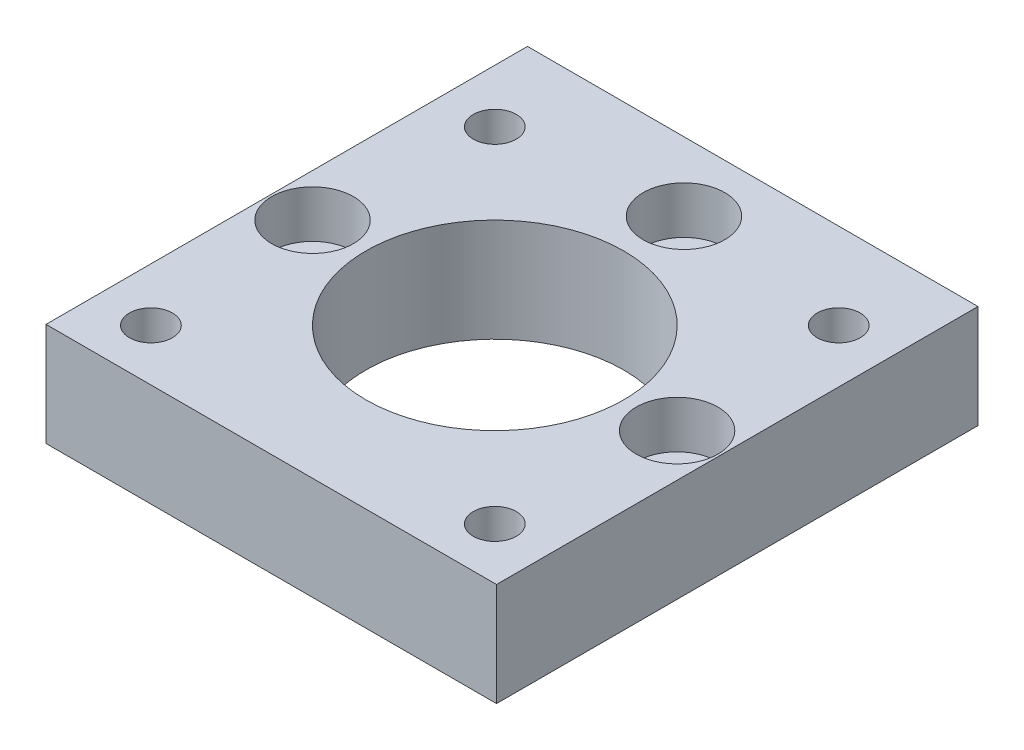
ISO-10303-21;
HEADER;
FILE_DESCRIPTION(('STEP AP214'),'2;1');
FILE_NAME('part.step','',(''),(''),'','','');
FILE_SCHEMA(('AUTOMOTIVE_DESIGN { 1 0 10303 214 1 1 1 1 }'));
ENDSEC;
DATA;
#1=APPLICATION_CONTEXT('core data for automotive mechanical design processes');
#2=APPLICATION_PROTOCOL_DEFINITION('international standard','automotive_design',2000,#1);
#3=PRODUCT_CONTEXT('',#1,'mechanical');
#4=PRODUCT('Part','Part','',(#3));
#5=PRODUCT_RELATED_PRODUCT_CATEGORY('part','',(#4));
#6=PRODUCT_DEFINITION_FORMATION('','',#4);
#7=PRODUCT_DEFINITION_CONTEXT('part definition',#1,'design');
#8=PRODUCT_DEFINITION('design','',#6,#7);
#9=PRODUCT_DEFINITION_SHAPE('','',#8);
#10=(LENGTH_UNIT() NAMED_UNIT(*) SI_UNIT(.MILLI.,.METRE.));
#11=(NAMED_UNIT(*) PLANE_ANGLE_UNIT() SI_UNIT($,.RADIAN.));
#12=(NAMED_UNIT(*) SI_UNIT($,.STERADIAN.) SOLID_ANGLE_UNIT());
#13=UNCERTAINTY_MEASURE_WITH_UNIT(LENGTH_MEASURE(1.E-05),#10,'distance_accuracy_value','');
#14=(GEOMETRIC_REPRESENTATION_CONTEXT(3) GLOBAL_UNCERTAINTY_ASSIGNED_CONTEXT((#13)) GLOBAL_UNIT_ASSIGNED_CONTEXT((#10,
#11,#12)) REPRESENTATION_CONTEXT('',''));
#15=CARTESIAN_POINT('',(0.,0.,0.));
#16=DIRECTION('',(0.,0.,1.));
#17=DIRECTION('',(1.,0.,0.));
#18=AXIS2_PLACEMENT_3D('',#15,#16,#17);
#19=CARTESIAN_POINT('',(26.2000000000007,-44.,8.));
#20=DIRECTION('',(0.,1.,0.));
#21=DIRECTION('',(0.,0.,1.));
#22=AXIS2_PLACEMENT_3D('',#19,#20,#21);
#23=CYLINDRICAL_SURFACE('',#22,2.75);
#24=CARTESIAN_POINT('',(26.2000000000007,0.,8.));
#25=DIRECTION('',(0.,1.,0.));
#26=DIRECTION('',(0.,0.,1.));
#27=AXIS2_PLACEMENT_3D('',#24,#25,#26);
#28=CIRCLE('',#27,2.75);
#29=CARTESIAN_POINT('',(26.2000000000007,0.,10.75));
#30=VERTEX_POINT('',#29);
#31=EDGE_CURVE('E111',#30,#30,#28,.T.);
#32=ORIENTED_EDGE('',*,*,#31,.F.);
#33=EDGE_LOOP('',(#32));
#34=FACE_BOUND('',#33,.T.);
#35=CARTESIAN_POINT('',(26.2000000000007,6.5,8.));
#36=DIRECTION('',(0.,1.,0.));
#37=DIRECTION('',(0.,0.,1.));
#38=AXIS2_PLACEMENT_3D('',#35,#36,#37);
#39=CIRCLE('',#38,2.75);
#40=CARTESIAN_POINT('',(26.2000000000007,6.5,10.75));
#41=VERTEX_POINT('',#40);
#42=EDGE_CURVE('E37',#41,#41,#39,.F.);
#43=ORIENTED_EDGE('',*,*,#42,.F.);
#44=EDGE_LOOP('',(#43));
#45=FACE_BOUND('',#44,.T.);
#46=ADVANCED_FACE('F33',(#34,#45),#23,.F.);
#47=CARTESIAN_POINT('',(5.,-44.,30.));
#48=DIRECTION('',(0.,1.,0.));
#49=DIRECTION('',(0.,0.,1.));
#50=AXIS2_PLACEMENT_3D('',#47,#48,#49);
#51=CYLINDRICAL_SURFACE('',#50,2.75);
#52=CARTESIAN_POINT('',(5.,0.,30.));
#53=DIRECTION('',(0.,1.,0.));
#54=DIRECTION('',(0.,0.,1.));
#55=AXIS2_PLACEMENT_3D('',#52,#53,#54);
#56=CIRCLE('',#55,2.75);
#57=CARTESIAN_POINT('',(5.,0.,32.75));
#58=VERTEX_POINT('',#57);
#59=EDGE_CURVE('E136',#58,#58,#56,.T.);
#60=ORIENTED_EDGE('',*,*,#59,.F.);
#61=EDGE_LOOP('',(#60));
#62=FACE_BOUND('',#61,.T.);
#63=CARTESIAN_POINT('',(5.,6.5,30.));
#64=DIRECTION('',(0.,1.,0.));
#65=DIRECTION('',(0.,0.,1.));
#66=AXIS2_PLACEMENT_3D('',#63,#64,#65);
#67=CIRCLE('',#66,2.75);
#68=CARTESIAN_POINT('',(5.,6.5,32.75));
#69=VERTEX_POINT('',#68);
#70=EDGE_CURVE('E113',#69,#69,#67,.F.);
#71=ORIENTED_EDGE('',*,*,#70,.F.);
#72=EDGE_LOOP('',(#71));
#73=FACE_BOUND('',#72,.T.);
#74=ADVANCED_FACE('F190',(#62,#73),#51,.F.);
#75=CARTESIAN_POINT('',(47.4000000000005,-44.,30.));
#76=DIRECTION('',(0.,1.,0.));
#77=DIRECTION('',(0.,0.,1.));
#78=AXIS2_PLACEMENT_3D('',#75,#76,#77);
#79=CYLINDRICAL_SURFACE('',#78,2.75);
#80=CARTESIAN_POINT('',(47.4000000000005,0.,30.));
#81=DIRECTION('',(0.,1.,0.));
#82=DIRECTION('',(0.,0.,1.));
#83=AXIS2_PLACEMENT_3D('',#80,#81,#82);
#84=CIRCLE('',#83,2.75);
#85=CARTESIAN_POINT('',(47.4000000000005,0.,32.75));
#86=VERTEX_POINT('',#85);
#87=EDGE_CURVE('E139',#86,#86,#84,.T.);
#88=ORIENTED_EDGE('',*,*,#87,.F.);
#89=EDGE_LOOP('',(#88));
#90=FACE_BOUND('',#89,.T.);
#91=CARTESIAN_POINT('',(47.4000000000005,6.5,30.));
#92=DIRECTION('',(0.,1.,0.));
#93=DIRECTION('',(0.,0.,1.));
#94=AXIS2_PLACEMENT_3D('',#91,#92,#93);
#95=CIRCLE('',#94,2.75);
#96=CARTESIAN_POINT('',(47.4000000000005,6.5,32.75));
#97=VERTEX_POINT('',#96);
#98=EDGE_CURVE('E109',#97,#97,#95,.F.);
#99=ORIENTED_EDGE('',*,*,#98,.F.);
#100=EDGE_LOOP('',(#99));
#101=FACE_BOUND('',#100,.T.);
#102=ADVANCED_FACE('F196',(#90,#101),#79,.F.);
#103=CARTESIAN_POINT('',(0.,0.,56.));
#104=DIRECTION('',(1.,0.,0.));
#105=DIRECTION('',(0.,0.,-1.));
#106=AXIS2_PLACEMENT_3D('',#103,#104,#105);
#107=PLANE('',#106);
#108=DIRECTION('',(0.,-1.,0.));
#109=VECTOR('',#108,1.);
#110=CARTESIAN_POINT('',(0.,0.,0.));
#111=LINE('',#110,#109);
#112=CARTESIAN_POINT('',(0.,12.,0.));
#113=VERTEX_POINT('',#112);
#114=CARTESIAN_POINT('',(0.,0.,0.));
#115=VERTEX_POINT('',#114);
#116=EDGE_CURVE('E100',#113,#115,#111,.T.);
#117=ORIENTED_EDGE('',*,*,#116,.T.);
#118=DIRECTION('',(0.,0.,-1.));
#119=VECTOR('',#118,1.);
#120=CARTESIAN_POINT('',(0.,0.,56.));
#121=LINE('',#120,#119);
#122=CARTESIAN_POINT('',(0.,0.,56.));
#123=VERTEX_POINT('',#122);
#124=EDGE_CURVE('E12',#123,#115,#121,.T.);
#125=ORIENTED_EDGE('',*,*,#124,.F.);
#126=DIRECTION('',(0.,-1.,0.));
#127=VECTOR('',#126,1.);
#128=CARTESIAN_POINT('',(0.,0.,56.));
#129=LINE('',#128,#127);
#130=CARTESIAN_POINT('',(0.,12.,56.));
#131=VERTEX_POINT('',#130);
#132=EDGE_CURVE('E87',#131,#123,#129,.T.);
#133=ORIENTED_EDGE('',*,*,#132,.F.);
#134=DIRECTION('',(0.,0.,-1.));
#135=VECTOR('',#134,1.);
#136=CARTESIAN_POINT('',(0.,12.,56.));
#137=LINE('',#136,#135);
#138=EDGE_CURVE('E96',#131,#113,#137,.T.);
#139=ORIENTED_EDGE('',*,*,#138,.T.);
#140=EDGE_LOOP('',(#117,#125,#133,#139));
#141=FACE_BOUND('',#140,.T.);
#142=ADVANCED_FACE('F35',(#141),#107,.F.);
#143=CARTESIAN_POINT('',(0.,0.,56.));
#144=DIRECTION('',(0.,1.,0.));
#145=DIRECTION('',(0.,0.,1.));
#146=AXIS2_PLACEMENT_3D('',#143,#144,#145);
#147=PLANE('',#146);
#148=ORIENTED_EDGE('',*,*,#31,.T.);
#149=EDGE_LOOP('',(#148));
#150=FACE_BOUND('',#149,.T.);
#151=ORIENTED_EDGE('',*,*,#59,.T.);
#152=EDGE_LOOP('',(#151));
#153=FACE_BOUND('',#152,.T.);
#154=ORIENTED_EDGE('',*,*,#87,.T.);
#155=EDGE_LOOP('',(#154));
#156=FACE_BOUND('',#155,.T.);
#157=CARTESIAN_POINT('',(6.20000000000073,0.,50.));
#158=DIRECTION('',(0.,1.,0.));
#159=DIRECTION('',(0.,0.,1.));
#160=AXIS2_PLACEMENT_3D('',#157,#158,#159);
#161=CIRCLE('',#160,2.5);
#162=CARTESIAN_POINT('',(6.20000000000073,0.,52.5));
#163=VERTEX_POINT('',#162);
#164=EDGE_CURVE('E145',#163,#163,#161,.T.);
#165=ORIENTED_EDGE('',*,*,#164,.T.);
#166=EDGE_LOOP('',(#165));
#167=FACE_BOUND('',#166,.T.);
#168=CARTESIAN_POINT('',(46.2000000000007,0.,50.));
#169=DIRECTION('',(0.,1.,0.));
#170=DIRECTION('',(0.,0.,1.));
#171=AXIS2_PLACEMENT_3D('',#168,#169,#170);
#172=CIRCLE('',#171,2.5);
#173=CARTESIAN_POINT('',(46.2000000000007,0.,52.5));
#174=VERTEX_POINT('',#173);
#175=EDGE_CURVE('E151',#174,#174,#172,.T.);
#176=ORIENTED_EDGE('',*,*,#175,.T.);
#177=EDGE_LOOP('',(#176));
#178=FACE_BOUND('',#177,.T.);
#179=CARTESIAN_POINT('',(46.2000000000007,0.,10.));
#180=DIRECTION('',(0.,1.,0.));
#181=DIRECTION('',(0.,0.,1.));
#182=AXIS2_PLACEMENT_3D('',#179,#180,#181);
#183=CIRCLE('',#182,2.5);
#184=CARTESIAN_POINT('',(46.2000000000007,0.,12.5));
#185=VERTEX_POINT('',#184);
#186=EDGE_CURVE('E157',#185,#185,#183,.T.);
#187=ORIENTED_EDGE('',*,*,#186,.T.);
#188=EDGE_LOOP('',(#187));
#189=FACE_BOUND('',#188,.T.);
#190=CARTESIAN_POINT('',(6.20000000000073,0.,10.));
#191=DIRECTION('',(0.,1.,0.));
#192=DIRECTION('',(0.,0.,1.));
#193=AXIS2_PLACEMENT_3D('',#190,#191,#192);
#194=CIRCLE('',#193,2.5);
#195=CARTESIAN_POINT('',(6.20000000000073,0.,12.5));
#196=VERTEX_POINT('',#195);
#197=EDGE_CURVE('E163',#196,#196,#194,.T.);
#198=ORIENTED_EDGE('',*,*,#197,.T.);
#199=EDGE_LOOP('',(#198));
#200=FACE_BOUND('',#199,.T.);
#201=CARTESIAN_POINT('',(26.2000000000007,0.,30.));
#202=DIRECTION('',(0.,1.,0.));
#203=DIRECTION('',(0.,0.,1.));
#204=AXIS2_PLACEMENT_3D('',#201,#202,#203);
#205=CIRCLE('',#204,15.);
#206=CARTESIAN_POINT('',(26.2000000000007,0.,45.));
#207=VERTEX_POINT('',#206);
#208=EDGE_CURVE('E103',#207,#207,#205,.T.);
#209=ORIENTED_EDGE('',*,*,#208,.T.);
#210=EDGE_LOOP('',(#209));
#211=FACE_BOUND('',#210,.T.);
#212=DIRECTION('',(1.,0.,0.));
#213=VECTOR('',#212,1.);
#214=CARTESIAN_POINT('',(0.,0.,0.));
#215=LINE('',#214,#213);
#216=CARTESIAN_POINT('',(52.4000000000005,0.,0.));
#217=VERTEX_POINT('',#216);
#218=EDGE_CURVE('E91',#115,#217,#215,.T.);
#219=ORIENTED_EDGE('',*,*,#218,.T.);
#220=DIRECTION('',(0.,0.,-1.));
#221=VECTOR('',#220,1.);
#222=CARTESIAN_POINT('',(52.4000000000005,0.,56.));
#223=LINE('',#222,#221);
#224=CARTESIAN_POINT('',(52.4000000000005,0.,56.));
#225=VERTEX_POINT('',#224);
#226=EDGE_CURVE('E43',#225,#217,#223,.T.);
#227=ORIENTED_EDGE('',*,*,#226,.F.);
#228=DIRECTION('',(1.,0.,0.));
#229=VECTOR('',#228,1.);
#230=CARTESIAN_POINT('',(0.,0.,56.));
#231=LINE('',#230,#229);
#232=EDGE_CURVE('E82',#123,#225,#231,.T.);
#233=ORIENTED_EDGE('',*,*,#232,.F.);
#234=ORIENTED_EDGE('',*,*,#124,.T.);
#235=EDGE_LOOP('',(#219,#227,#233,#234));
#236=FACE_BOUND('',#235,.T.);
#237=ADVANCED_FACE('F90',(#150,#153,#156,#167,#178,#189,#200,#211,#236),#147,.F.);
#238=CARTESIAN_POINT('',(52.4000000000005,0.,56.));
#239=DIRECTION('',(-1.,0.,0.));
#240=DIRECTION('',(0.,0.,1.));
#241=AXIS2_PLACEMENT_3D('',#238,#239,#240);
#242=PLANE('',#241);
#243=DIRECTION('',(0.,1.,0.));
#244=VECTOR('',#243,1.);
#245=CARTESIAN_POINT('',(52.4000000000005,0.,0.));
#246=LINE('',#245,#244);
#247=CARTESIAN_POINT('',(52.4000000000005,12.,0.));
#248=VERTEX_POINT('',#247);
#249=EDGE_CURVE('E69',#217,#248,#246,.T.);
#250=ORIENTED_EDGE('',*,*,#249,.T.);
#251=DIRECTION('',(0.,0.,-1.));
#252=VECTOR('',#251,1.);
#253=CARTESIAN_POINT('',(52.4000000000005,12.,56.));
#254=LINE('',#253,#252);
#255=CARTESIAN_POINT('',(52.4000000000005,12.,56.));
#256=VERTEX_POINT('',#255);
#257=EDGE_CURVE('E92',#256,#248,#254,.T.);
#258=ORIENTED_EDGE('',*,*,#257,.F.);
#259=DIRECTION('',(0.,1.,0.));
#260=VECTOR('',#259,1.);
#261=CARTESIAN_POINT('',(52.4000000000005,0.,56.));
#262=LINE('',#261,#260);
#263=EDGE_CURVE('E85',#225,#256,#262,.T.);
#264=ORIENTED_EDGE('',*,*,#263,.F.);
#265=ORIENTED_EDGE('',*,*,#226,.T.);
#266=EDGE_LOOP('',(#250,#258,#264,#265));
#267=FACE_BOUND('',#266,.T.);
#268=ADVANCED_FACE('F94',(#267),#242,.F.);
#269=CARTESIAN_POINT('',(0.,12.,56.));
#270=DIRECTION('',(0.,-1.,0.));
#271=DIRECTION('',(0.,0.,-1.));
#272=AXIS2_PLACEMENT_3D('',#269,#270,#271);
#273=PLANE('',#272);
#274=CARTESIAN_POINT('',(26.2000000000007,12.,8.));
#275=DIRECTION('',(0.,1.,0.));
#276=DIRECTION('',(0.,0.,1.));
#277=AXIS2_PLACEMENT_3D('',#274,#275,#276);
#278=CIRCLE('',#277,4.75);
#279=CARTESIAN_POINT('',(26.2000000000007,12.,12.75));
#280=VERTEX_POINT('',#279);
#281=EDGE_CURVE('E129',#280,#280,#278,.T.);
#282=ORIENTED_EDGE('',*,*,#281,.F.);
#283=EDGE_LOOP('',(#282));
#284=FACE_BOUND('',#283,.T.);
#285=CARTESIAN_POINT('',(5.,12.,30.));
#286=DIRECTION('',(0.,1.,0.));
#287=DIRECTION('',(0.,0.,1.));
#288=AXIS2_PLACEMENT_3D('',#285,#286,#287);
#289=CIRCLE('',#288,4.75);
#290=CARTESIAN_POINT('',(5.,12.,34.75));
#291=VERTEX_POINT('',#290);
#292=EDGE_CURVE('E122',#291,#291,#289,.T.);
#293=ORIENTED_EDGE('',*,*,#292,.F.);
#294=EDGE_LOOP('',(#293));
#295=FACE_BOUND('',#294,.T.);
#296=CARTESIAN_POINT('',(47.4000000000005,12.,30.));
#297=DIRECTION('',(0.,1.,0.));
#298=DIRECTION('',(0.,0.,1.));
#299=AXIS2_PLACEMENT_3D('',#296,#297,#298);
#300=CIRCLE('',#299,4.75);
#301=CARTESIAN_POINT('',(47.4000000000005,12.,34.75));
#302=VERTEX_POINT('',#301);
#303=EDGE_CURVE('E115',#302,#302,#300,.T.);
#304=ORIENTED_EDGE('',*,*,#303,.F.);
#305=EDGE_LOOP('',(#304));
#306=FACE_BOUND('',#305,.T.);
#307=CARTESIAN_POINT('',(6.20000000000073,12.,50.));
#308=DIRECTION('',(0.,1.,0.));
#309=DIRECTION('',(0.,0.,1.));
#310=AXIS2_PLACEMENT_3D('',#307,#308,#309);
#311=CIRCLE('',#310,2.5);
#312=CARTESIAN_POINT('',(6.20000000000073,12.,52.5));
#313=VERTEX_POINT('',#312);
#314=EDGE_CURVE('E142',#313,#313,#311,.T.);
#315=ORIENTED_EDGE('',*,*,#314,.F.);
#316=EDGE_LOOP('',(#315));
#317=FACE_BOUND('',#316,.T.);
#318=CARTESIAN_POINT('',(46.2000000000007,12.,50.));
#319=DIRECTION('',(0.,1.,0.));
#320=DIRECTION('',(0.,0.,1.));
#321=AXIS2_PLACEMENT_3D('',#318,#319,#320);
#322=CIRCLE('',#321,2.5);
#323=CARTESIAN_POINT('',(46.2000000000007,12.,52.5));
#324=VERTEX_POINT('',#323);
#325=EDGE_CURVE('E148',#324,#324,#322,.T.);
#326=ORIENTED_EDGE('',*,*,#325,.F.);
#327=EDGE_LOOP('',(#326));
#328=FACE_BOUND('',#327,.T.);
#329=CARTESIAN_POINT('',(46.2000000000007,12.,10.));
#330=DIRECTION('',(0.,1.,0.));
#331=DIRECTION('',(0.,0.,1.));
#332=AXIS2_PLACEMENT_3D('',#329,#330,#331);
#333=CIRCLE('',#332,2.5);
#334=CARTESIAN_POINT('',(46.2000000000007,12.,12.5));
#335=VERTEX_POINT('',#334);
#336=EDGE_CURVE('E154',#335,#335,#333,.T.);
#337=ORIENTED_EDGE('',*,*,#336,.F.);
#338=EDGE_LOOP('',(#337));
#339=FACE_BOUND('',#338,.T.);
#340=CARTESIAN_POINT('',(6.20000000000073,12.,10.));
#341=DIRECTION('',(0.,1.,0.));
#342=DIRECTION('',(0.,0.,1.));
#343=AXIS2_PLACEMENT_3D('',#340,#341,#342);
#344=CIRCLE('',#343,2.5);
#345=CARTESIAN_POINT('',(6.20000000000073,12.,12.5));
#346=VERTEX_POINT('',#345);
#347=EDGE_CURVE('E160',#346,#346,#344,.T.);
#348=ORIENTED_EDGE('',*,*,#347,.F.);
#349=EDGE_LOOP('',(#348));
#350=FACE_BOUND('',#349,.T.);
#351=CARTESIAN_POINT('',(26.2000000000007,12.,30.));
#352=DIRECTION('',(0.,1.,0.));
#353=DIRECTION('',(0.,0.,1.));
#354=AXIS2_PLACEMENT_3D('',#351,#352,#353);
#355=CIRCLE('',#354,15.);
#356=CARTESIAN_POINT('',(26.2000000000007,12.,45.));
#357=VERTEX_POINT('',#356);
#358=EDGE_CURVE('E166',#357,#357,#355,.T.);
#359=ORIENTED_EDGE('',*,*,#358,.F.);
#360=EDGE_LOOP('',(#359));
#361=FACE_BOUND('',#360,.T.);
#362=DIRECTION('',(-1.,0.,0.));
#363=VECTOR('',#362,1.);
#364=CARTESIAN_POINT('',(0.,12.,0.));
#365=LINE('',#364,#363);
#366=EDGE_CURVE('E75',#248,#113,#365,.T.);
#367=ORIENTED_EDGE('',*,*,#366,.T.);
#368=ORIENTED_EDGE('',*,*,#138,.F.);
#369=DIRECTION('',(-1.,0.,0.));
#370=VECTOR('',#369,1.);
#371=CARTESIAN_POINT('',(0.,12.,56.));
#372=LINE('',#371,#370);
#373=EDGE_CURVE('E52',#256,#131,#372,.T.);
#374=ORIENTED_EDGE('',*,*,#373,.F.);
#375=ORIENTED_EDGE('',*,*,#257,.T.);
#376=EDGE_LOOP('',(#367,#368,#374,#375));
#377=FACE_BOUND('',#376,.T.);
#378=ADVANCED_FACE('F234',(#284,#295,#306,#317,#328,#339,#350,#361,#377),#273,.F.);
#379=CARTESIAN_POINT('',(0.,12.,56.));
#380=DIRECTION('',(0.,0.,-1.));
#381=DIRECTION('',(-1.,0.,0.));
#382=AXIS2_PLACEMENT_3D('',#379,#380,#381);
#383=PLANE('',#382);
#384=ORIENTED_EDGE('',*,*,#132,.T.);
#385=ORIENTED_EDGE('',*,*,#232,.T.);
#386=ORIENTED_EDGE('',*,*,#263,.T.);
#387=ORIENTED_EDGE('',*,*,#373,.T.);
#388=EDGE_LOOP('',(#384,#385,#386,#387));
#389=FACE_BOUND('',#388,.T.);
#390=ADVANCED_FACE('F83',(#389),#383,.F.);
#391=CARTESIAN_POINT('',(0.,12.,0.));
#392=DIRECTION('',(0.,0.,-1.));
#393=DIRECTION('',(-1.,0.,0.));
#394=AXIS2_PLACEMENT_3D('',#391,#392,#393);
#395=PLANE('',#394);
#396=ORIENTED_EDGE('',*,*,#116,.F.);
#397=ORIENTED_EDGE('',*,*,#366,.F.);
#398=ORIENTED_EDGE('',*,*,#249,.F.);
#399=ORIENTED_EDGE('',*,*,#218,.F.);
#400=EDGE_LOOP('',(#396,#397,#398,#399));
#401=FACE_BOUND('',#400,.T.);
#402=ADVANCED_FACE('F176',(#401),#395,.T.);
#403=CARTESIAN_POINT('',(26.2000000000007,-44.,30.));
#404=DIRECTION('',(0.,1.,0.));
#405=DIRECTION('',(0.,0.,1.));
#406=AXIS2_PLACEMENT_3D('',#403,#404,#405);
#407=CYLINDRICAL_SURFACE('',#406,15.);
#408=ORIENTED_EDGE('',*,*,#358,.T.);
#409=EDGE_LOOP('',(#408));
#410=FACE_BOUND('',#409,.T.);
#411=ORIENTED_EDGE('',*,*,#208,.F.);
#412=EDGE_LOOP('',(#411));
#413=FACE_BOUND('',#412,.T.);
#414=ADVANCED_FACE('F173',(#410,#413),#407,.F.);
#415=CARTESIAN_POINT('',(6.20000000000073,-44.,10.));
#416=DIRECTION('',(0.,1.,0.));
#417=DIRECTION('',(0.,0.,1.));
#418=AXIS2_PLACEMENT_3D('',#415,#416,#417);
#419=CYLINDRICAL_SURFACE('',#418,2.5);
#420=ORIENTED_EDGE('',*,*,#347,.T.);
#421=EDGE_LOOP('',(#420));
#422=FACE_BOUND('',#421,.T.);
#423=ORIENTED_EDGE('',*,*,#197,.F.);
#424=EDGE_LOOP('',(#423));
#425=FACE_BOUND('',#424,.T.);
#426=ADVANCED_FACE('F175',(#422,#425),#419,.F.);
#427=CARTESIAN_POINT('',(46.2000000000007,-44.,10.));
#428=DIRECTION('',(0.,1.,0.));
#429=DIRECTION('',(0.,0.,1.));
#430=AXIS2_PLACEMENT_3D('',#427,#428,#429);
#431=CYLINDRICAL_SURFACE('',#430,2.5);
#432=ORIENTED_EDGE('',*,*,#336,.T.);
#433=EDGE_LOOP('',(#432));
#434=FACE_BOUND('',#433,.T.);
#435=ORIENTED_EDGE('',*,*,#186,.F.);
#436=EDGE_LOOP('',(#435));
#437=FACE_BOUND('',#436,.T.);
#438=ADVANCED_FACE('F183',(#434,#437),#431,.F.);
#439=CARTESIAN_POINT('',(46.2000000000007,-44.,50.));
#440=DIRECTION('',(0.,1.,0.));
#441=DIRECTION('',(0.,0.,1.));
#442=AXIS2_PLACEMENT_3D('',#439,#440,#441);
#443=CYLINDRICAL_SURFACE('',#442,2.5);
#444=ORIENTED_EDGE('',*,*,#325,.T.);
#445=EDGE_LOOP('',(#444));
#446=FACE_BOUND('',#445,.T.);
#447=ORIENTED_EDGE('',*,*,#175,.F.);
#448=EDGE_LOOP('',(#447));
#449=FACE_BOUND('',#448,.T.);
#450=ADVANCED_FACE('F212',(#446,#449),#443,.F.);
#451=CARTESIAN_POINT('',(6.20000000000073,-44.,50.));
#452=DIRECTION('',(0.,1.,0.));
#453=DIRECTION('',(0.,0.,1.));
#454=AXIS2_PLACEMENT_3D('',#451,#452,#453);
#455=CYLINDRICAL_SURFACE('',#454,2.5);
#456=ORIENTED_EDGE('',*,*,#314,.T.);
#457=EDGE_LOOP('',(#456));
#458=FACE_BOUND('',#457,.T.);
#459=ORIENTED_EDGE('',*,*,#164,.F.);
#460=EDGE_LOOP('',(#459));
#461=FACE_BOUND('',#460,.T.);
#462=ADVANCED_FACE('F208',(#458,#461),#455,.F.);
#463=CARTESIAN_POINT('',(47.4000000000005,6.5,30.));
#464=DIRECTION('',(0.,1.,0.));
#465=DIRECTION('',(0.,0.,1.));
#466=AXIS2_PLACEMENT_3D('',#463,#464,#465);
#467=PLANE('',#466);
#468=CARTESIAN_POINT('',(47.4000000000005,6.5,30.));
#469=DIRECTION('',(0.,1.,0.));
#470=DIRECTION('',(0.,0.,1.));
#471=AXIS2_PLACEMENT_3D('',#468,#469,#470);
#472=CIRCLE('',#471,4.75);
#473=CARTESIAN_POINT('',(47.4000000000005,6.5,34.75));
#474=VERTEX_POINT('',#473);
#475=EDGE_CURVE('E112',#474,#474,#472,.T.);
#476=ORIENTED_EDGE('',*,*,#475,.T.);
#477=EDGE_LOOP('',(#476));
#478=FACE_BOUND('',#477,.T.);
#479=ORIENTED_EDGE('',*,*,#98,.T.);
#480=EDGE_LOOP('',(#479));
#481=FACE_BOUND('',#480,.T.);
#482=ADVANCED_FACE('F211',(#478,#481),#467,.T.);
#483=CARTESIAN_POINT('',(47.4000000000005,6.5,30.));
#484=DIRECTION('',(0.,1.,0.));
#485=DIRECTION('',(0.,0.,1.));
#486=AXIS2_PLACEMENT_3D('',#483,#484,#485);
#487=CYLINDRICAL_SURFACE('',#486,4.75);
#488=ORIENTED_EDGE('',*,*,#475,.F.);
#489=EDGE_LOOP('',(#488));
#490=FACE_BOUND('',#489,.T.);
#491=ORIENTED_EDGE('',*,*,#303,.T.);
#492=EDGE_LOOP('',(#491));
#493=FACE_BOUND('',#492,.T.);
#494=ADVANCED_FACE('F202',(#490,#493),#487,.F.);
#495=CARTESIAN_POINT('',(5.,6.5,30.));
#496=DIRECTION('',(0.,1.,0.));
#497=DIRECTION('',(0.,0.,1.));
#498=AXIS2_PLACEMENT_3D('',#495,#496,#497);
#499=PLANE('',#498);
#500=CARTESIAN_POINT('',(5.,6.5,30.));
#501=DIRECTION('',(0.,1.,0.));
#502=DIRECTION('',(0.,0.,1.));
#503=AXIS2_PLACEMENT_3D('',#500,#501,#502);
#504=CIRCLE('',#503,4.75);
#505=CARTESIAN_POINT('',(5.,6.5,34.75));
#506=VERTEX_POINT('',#505);
#507=EDGE_CURVE('E116',#506,#506,#504,.T.);
#508=ORIENTED_EDGE('',*,*,#507,.T.);
#509=EDGE_LOOP('',(#508));
#510=FACE_BOUND('',#509,.T.);
#511=ORIENTED_EDGE('',*,*,#70,.T.);
#512=EDGE_LOOP('',(#511));
#513=FACE_BOUND('',#512,.T.);
#514=ADVANCED_FACE('F320',(#510,#513),#499,.T.);
#515=CARTESIAN_POINT('',(5.,6.5,30.));
#516=DIRECTION('',(0.,1.,0.));
#517=DIRECTION('',(0.,0.,1.));
#518=AXIS2_PLACEMENT_3D('',#515,#516,#517);
#519=CYLINDRICAL_SURFACE('',#518,4.75);
#520=ORIENTED_EDGE('',*,*,#507,.F.);
#521=EDGE_LOOP('',(#520));
#522=FACE_BOUND('',#521,.T.);
#523=ORIENTED_EDGE('',*,*,#292,.T.);
#524=EDGE_LOOP('',(#523));
#525=FACE_BOUND('',#524,.T.);
#526=ADVANCED_FACE('F329',(#522,#525),#519,.F.);
#527=CARTESIAN_POINT('',(26.2000000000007,6.5,8.));
#528=DIRECTION('',(0.,1.,0.));
#529=DIRECTION('',(0.,0.,1.));
#530=AXIS2_PLACEMENT_3D('',#527,#528,#529);
#531=PLANE('',#530);
#532=CARTESIAN_POINT('',(26.2000000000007,6.5,8.));
#533=DIRECTION('',(0.,1.,0.));
#534=DIRECTION('',(0.,0.,1.));
#535=AXIS2_PLACEMENT_3D('',#532,#533,#534);
#536=CIRCLE('',#535,4.75);
#537=CARTESIAN_POINT('',(26.2000000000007,6.5,12.75));
#538=VERTEX_POINT('',#537);
#539=EDGE_CURVE('E365',#538,#538,#536,.T.);
#540=ORIENTED_EDGE('',*,*,#539,.T.);
#541=EDGE_LOOP('',(#540));
#542=FACE_BOUND('',#541,.T.);
#543=ORIENTED_EDGE('',*,*,#42,.T.);
#544=EDGE_LOOP('',(#543));
#545=FACE_BOUND('',#544,.T.);
#546=ADVANCED_FACE('F338',(#542,#545),#531,.T.);
#547=CARTESIAN_POINT('',(26.2000000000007,6.5,8.));
#548=DIRECTION('',(0.,1.,0.));
#549=DIRECTION('',(0.,0.,1.));
#550=AXIS2_PLACEMENT_3D('',#547,#548,#549);
#551=CYLINDRICAL_SURFACE('',#550,4.75);
#552=ORIENTED_EDGE('',*,*,#539,.F.);
#553=EDGE_LOOP('',(#552));
#554=FACE_BOUND('',#553,.T.);
#555=ORIENTED_EDGE('',*,*,#281,.T.);
#556=EDGE_LOOP('',(#555));
#557=FACE_BOUND('',#556,.T.);
#558=ADVANCED_FACE('F348',(#554,#557),#551,.F.);
#559=CLOSED_SHELL('',(#46,#74,#102,#142,#237,#268,#378,#390,#402,#414,#426,#438,#450,#462,#482,
#494,#514,#526,#546,#558));
#560=MANIFOLD_SOLID_BREP('B2',#559);
#561=ADVANCED_BREP_SHAPE_REPRESENTATION('',(#18,#560),#14);
#562=SHAPE_DEFINITION_REPRESENTATION(#9,#561);
ENDSEC;
END-ISO-10303-21;
